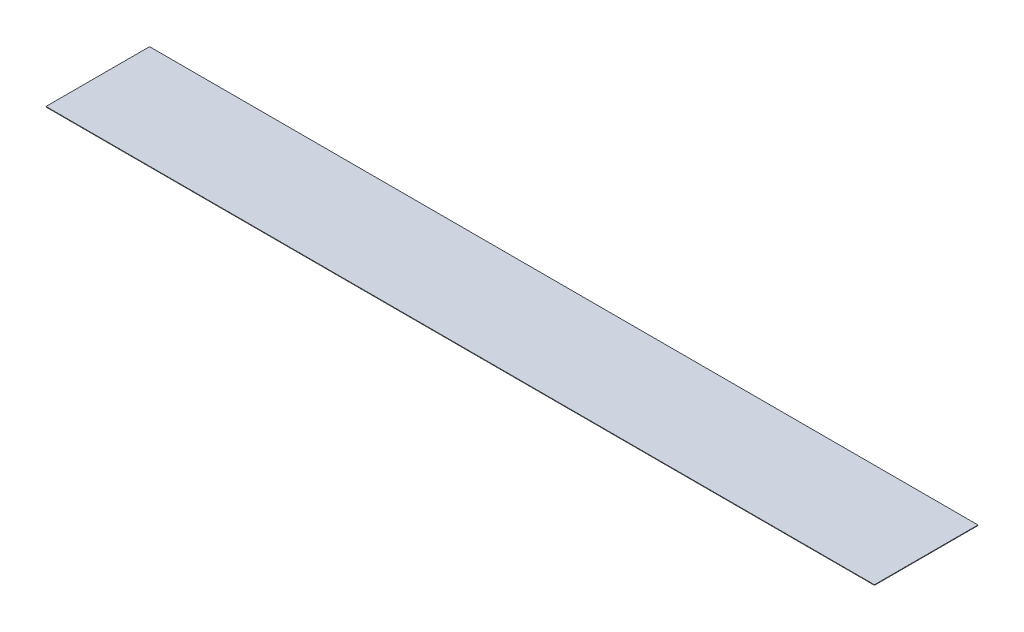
ISO-10303-21;
HEADER;
FILE_DESCRIPTION(('STEP AP214'),'2;1');
FILE_NAME('part.step','',(''),(''),'','','');
FILE_SCHEMA(('AUTOMOTIVE_DESIGN { 1 0 10303 214 1 1 1 1 }'));
ENDSEC;
DATA;
#1=APPLICATION_CONTEXT('core data for automotive mechanical design processes');
#2=APPLICATION_PROTOCOL_DEFINITION('international standard','automotive_design',2000,#1);
#3=PRODUCT_CONTEXT('',#1,'mechanical');
#4=PRODUCT('Part','Part','',(#3));
#5=PRODUCT_RELATED_PRODUCT_CATEGORY('part','',(#4));
#6=PRODUCT_DEFINITION_FORMATION('','',#4);
#7=PRODUCT_DEFINITION_CONTEXT('part definition',#1,'design');
#8=PRODUCT_DEFINITION('design','',#6,#7);
#9=PRODUCT_DEFINITION_SHAPE('','',#8);
#10=(LENGTH_UNIT() NAMED_UNIT(*) SI_UNIT(.MILLI.,.METRE.));
#11=(NAMED_UNIT(*) PLANE_ANGLE_UNIT() SI_UNIT($,.RADIAN.));
#12=(NAMED_UNIT(*) SI_UNIT($,.STERADIAN.) SOLID_ANGLE_UNIT());
#13=UNCERTAINTY_MEASURE_WITH_UNIT(LENGTH_MEASURE(1.E-05),#10,'distance_accuracy_value','');
#14=(GEOMETRIC_REPRESENTATION_CONTEXT(3) GLOBAL_UNCERTAINTY_ASSIGNED_CONTEXT((#13)) GLOBAL_UNIT_ASSIGNED_CONTEXT((#10,
#11,#12)) REPRESENTATION_CONTEXT('',''));
#15=CARTESIAN_POINT('',(0.,0.,0.));
#16=DIRECTION('',(0.,0.,1.));
#17=DIRECTION('',(1.,0.,0.));
#18=AXIS2_PLACEMENT_3D('',#15,#16,#17);
#19=CARTESIAN_POINT('',(203.2,0.254,25.4));
#20=DIRECTION('',(-1.,0.,0.));
#21=DIRECTION('',(0.,0.,1.));
#22=AXIS2_PLACEMENT_3D('',#19,#20,#21);
#23=PLANE('',#22);
#24=DIRECTION('',(0.,0.,-1.));
#25=VECTOR('',#24,1.);
#26=CARTESIAN_POINT('',(203.2,0.,25.4));
#27=LINE('',#26,#25);
#28=CARTESIAN_POINT('',(203.2,0.,25.4));
#29=VERTEX_POINT('',#28);
#30=CARTESIAN_POINT('',(203.2,0.,-25.4));
#31=VERTEX_POINT('',#30);
#32=EDGE_CURVE('E97',#29,#31,#27,.T.);
#33=ORIENTED_EDGE('',*,*,#32,.T.);
#34=DIRECTION('',(0.,-1.,0.));
#35=VECTOR('',#34,1.);
#36=CARTESIAN_POINT('',(203.2,0.254,-25.4));
#37=LINE('',#36,#35);
#38=CARTESIAN_POINT('',(203.2,0.254,-25.4));
#39=VERTEX_POINT('',#38);
#40=EDGE_CURVE('E11',#39,#31,#37,.T.);
#41=ORIENTED_EDGE('',*,*,#40,.F.);
#42=DIRECTION('',(0.,0.,-1.));
#43=VECTOR('',#42,1.);
#44=CARTESIAN_POINT('',(203.2,0.254,25.4));
#45=LINE('',#44,#43);
#46=CARTESIAN_POINT('',(203.2,0.254,25.4));
#47=VERTEX_POINT('',#46);
#48=EDGE_CURVE('E85',#47,#39,#45,.T.);
#49=ORIENTED_EDGE('',*,*,#48,.F.);
#50=DIRECTION('',(0.,-1.,0.));
#51=VECTOR('',#50,1.);
#52=CARTESIAN_POINT('',(203.2,0.254,25.4));
#53=LINE('',#52,#51);
#54=EDGE_CURVE('E93',#47,#29,#53,.T.);
#55=ORIENTED_EDGE('',*,*,#54,.T.);
#56=EDGE_LOOP('',(#33,#41,#49,#55));
#57=FACE_BOUND('',#56,.T.);
#58=ADVANCED_FACE('F34',(#57),#23,.F.);
#59=CARTESIAN_POINT('',(-203.2,0.254,-25.4));
#60=DIRECTION('',(0.,0.,1.));
#61=DIRECTION('',(1.,0.,0.));
#62=AXIS2_PLACEMENT_3D('',#59,#60,#61);
#63=PLANE('',#62);
#64=DIRECTION('',(-1.,0.,0.));
#65=VECTOR('',#64,1.);
#66=CARTESIAN_POINT('',(-203.2,0.,-25.4));
#67=LINE('',#66,#65);
#68=CARTESIAN_POINT('',(-203.2,0.,-25.4));
#69=VERTEX_POINT('',#68);
#70=EDGE_CURVE('E89',#31,#69,#67,.T.);
#71=ORIENTED_EDGE('',*,*,#70,.T.);
#72=DIRECTION('',(0.,-1.,0.));
#73=VECTOR('',#72,1.);
#74=CARTESIAN_POINT('',(-203.2,0.254,-25.4));
#75=LINE('',#74,#73);
#76=CARTESIAN_POINT('',(-203.2,0.254,-25.4));
#77=VERTEX_POINT('',#76);
#78=EDGE_CURVE('E42',#77,#69,#75,.T.);
#79=ORIENTED_EDGE('',*,*,#78,.F.);
#80=DIRECTION('',(-1.,0.,0.));
#81=VECTOR('',#80,1.);
#82=CARTESIAN_POINT('',(-203.2,0.254,-25.4));
#83=LINE('',#82,#81);
#84=EDGE_CURVE('E80',#39,#77,#83,.T.);
#85=ORIENTED_EDGE('',*,*,#84,.F.);
#86=ORIENTED_EDGE('',*,*,#40,.T.);
#87=EDGE_LOOP('',(#71,#79,#85,#86));
#88=FACE_BOUND('',#87,.T.);
#89=ADVANCED_FACE('F88',(#88),#63,.F.);
#90=CARTESIAN_POINT('',(-203.2,0.254,25.4));
#91=DIRECTION('',(1.,0.,0.));
#92=DIRECTION('',(0.,0.,-1.));
#93=AXIS2_PLACEMENT_3D('',#90,#91,#92);
#94=PLANE('',#93);
#95=DIRECTION('',(0.,0.,1.));
#96=VECTOR('',#95,1.);
#97=CARTESIAN_POINT('',(-203.2,0.,25.4));
#98=LINE('',#97,#96);
#99=CARTESIAN_POINT('',(-203.2,0.,25.4));
#100=VERTEX_POINT('',#99);
#101=EDGE_CURVE('E67',#69,#100,#98,.T.);
#102=ORIENTED_EDGE('',*,*,#101,.T.);
#103=DIRECTION('',(0.,-1.,0.));
#104=VECTOR('',#103,1.);
#105=CARTESIAN_POINT('',(-203.2,0.254,25.4));
#106=LINE('',#105,#104);
#107=CARTESIAN_POINT('',(-203.2,0.254,25.4));
#108=VERTEX_POINT('',#107);
#109=EDGE_CURVE('E90',#108,#100,#106,.T.);
#110=ORIENTED_EDGE('',*,*,#109,.F.);
#111=DIRECTION('',(0.,0.,1.));
#112=VECTOR('',#111,1.);
#113=CARTESIAN_POINT('',(-203.2,0.254,25.4));
#114=LINE('',#113,#112);
#115=EDGE_CURVE('E83',#77,#108,#114,.T.);
#116=ORIENTED_EDGE('',*,*,#115,.F.);
#117=ORIENTED_EDGE('',*,*,#78,.T.);
#118=EDGE_LOOP('',(#102,#110,#116,#117));
#119=FACE_BOUND('',#118,.T.);
#120=ADVANCED_FACE('F91',(#119),#94,.F.);
#121=CARTESIAN_POINT('',(-203.2,0.254,25.4));
#122=DIRECTION('',(0.,0.,-1.));
#123=DIRECTION('',(-1.,0.,0.));
#124=AXIS2_PLACEMENT_3D('',#121,#122,#123);
#125=PLANE('',#124);
#126=DIRECTION('',(1.,0.,0.));
#127=VECTOR('',#126,1.);
#128=CARTESIAN_POINT('',(-203.2,0.,25.4));
#129=LINE('',#128,#127);
#130=EDGE_CURVE('E73',#100,#29,#129,.T.);
#131=ORIENTED_EDGE('',*,*,#130,.T.);
#132=ORIENTED_EDGE('',*,*,#54,.F.);
#133=DIRECTION('',(1.,0.,0.));
#134=VECTOR('',#133,1.);
#135=CARTESIAN_POINT('',(-203.2,0.254,25.4));
#136=LINE('',#135,#134);
#137=EDGE_CURVE('E50',#108,#47,#136,.T.);
#138=ORIENTED_EDGE('',*,*,#137,.F.);
#139=ORIENTED_EDGE('',*,*,#109,.T.);
#140=EDGE_LOOP('',(#131,#132,#138,#139));
#141=FACE_BOUND('',#140,.T.);
#142=ADVANCED_FACE('F104',(#141),#125,.F.);
#143=CARTESIAN_POINT('',(0.,0.254,0.));
#144=DIRECTION('',(0.,-1.,0.));
#145=DIRECTION('',(0.,0.,-1.));
#146=AXIS2_PLACEMENT_3D('',#143,#144,#145);
#147=PLANE('',#146);
#148=ORIENTED_EDGE('',*,*,#48,.T.);
#149=ORIENTED_EDGE('',*,*,#84,.T.);
#150=ORIENTED_EDGE('',*,*,#115,.T.);
#151=ORIENTED_EDGE('',*,*,#137,.T.);
#152=EDGE_LOOP('',(#148,#149,#150,#151));
#153=FACE_BOUND('',#152,.T.);
#154=ADVANCED_FACE('F81',(#153),#147,.F.);
#155=CARTESIAN_POINT('',(0.,0.,0.));
#156=DIRECTION('',(0.,-1.,0.));
#157=DIRECTION('',(0.,0.,-1.));
#158=AXIS2_PLACEMENT_3D('',#155,#156,#157);
#159=PLANE('',#158);
#160=ORIENTED_EDGE('',*,*,#32,.F.);
#161=ORIENTED_EDGE('',*,*,#130,.F.);
#162=ORIENTED_EDGE('',*,*,#101,.F.);
#163=ORIENTED_EDGE('',*,*,#70,.F.);
#164=EDGE_LOOP('',(#160,#161,#162,#163));
#165=FACE_BOUND('',#164,.T.);
#166=ADVANCED_FACE('F107',(#165),#159,.T.);
#167=CLOSED_SHELL('',(#58,#89,#120,#142,#154,#166));
#168=MANIFOLD_SOLID_BREP('B2',#167);
#169=ADVANCED_BREP_SHAPE_REPRESENTATION('',(#18,#168),#14);
#170=SHAPE_DEFINITION_REPRESENTATION(#9,#169);
ENDSEC;
END-ISO-10303-21;
